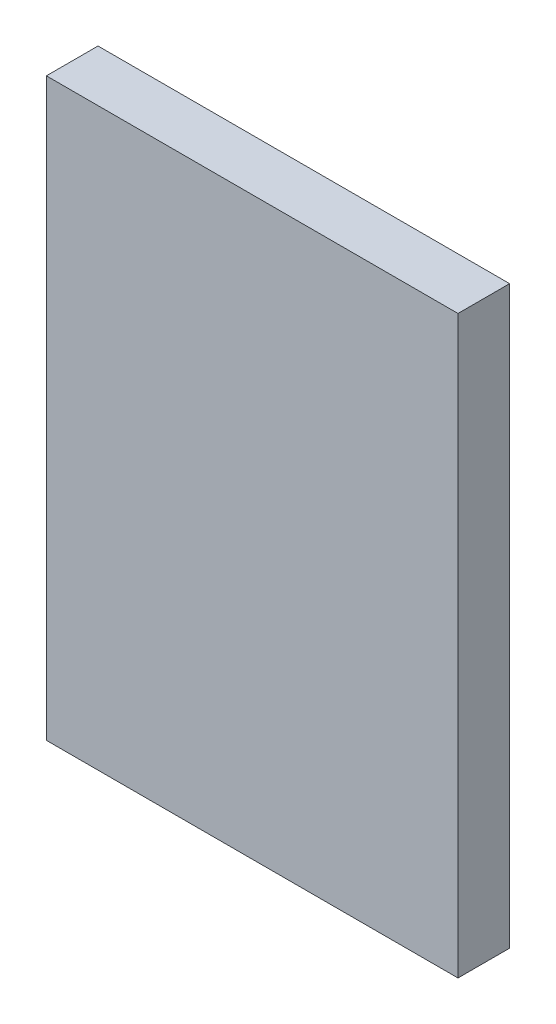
ISO-10303-21;
HEADER;
FILE_DESCRIPTION(('STEP AP214'),'2;1');
FILE_NAME('part.step','',(''),(''),'','','');
FILE_SCHEMA(('AUTOMOTIVE_DESIGN { 1 0 10303 214 1 1 1 1 }'));
ENDSEC;
DATA;
#1=APPLICATION_CONTEXT('core data for automotive mechanical design processes');
#2=APPLICATION_PROTOCOL_DEFINITION('international standard','automotive_design',2000,#1);
#3=PRODUCT_CONTEXT('',#1,'mechanical');
#4=PRODUCT('Part','Part','',(#3));
#5=PRODUCT_RELATED_PRODUCT_CATEGORY('part','',(#4));
#6=PRODUCT_DEFINITION_FORMATION('','',#4);
#7=PRODUCT_DEFINITION_CONTEXT('part definition',#1,'design');
#8=PRODUCT_DEFINITION('design','',#6,#7);
#9=PRODUCT_DEFINITION_SHAPE('','',#8);
#10=(LENGTH_UNIT() NAMED_UNIT(*) SI_UNIT(.MILLI.,.METRE.));
#11=(NAMED_UNIT(*) PLANE_ANGLE_UNIT() SI_UNIT($,.RADIAN.));
#12=(NAMED_UNIT(*) SI_UNIT($,.STERADIAN.) SOLID_ANGLE_UNIT());
#13=UNCERTAINTY_MEASURE_WITH_UNIT(LENGTH_MEASURE(1.E-05),#10,'distance_accuracy_value','');
#14=(GEOMETRIC_REPRESENTATION_CONTEXT(3) GLOBAL_UNCERTAINTY_ASSIGNED_CONTEXT((#13)) GLOBAL_UNIT_ASSIGNED_CONTEXT((#10,
#11,#12)) REPRESENTATION_CONTEXT('',''));
#15=CARTESIAN_POINT('',(0.,0.,0.));
#16=DIRECTION('',(0.,0.,1.));
#17=DIRECTION('',(1.,0.,0.));
#18=AXIS2_PLACEMENT_3D('',#15,#16,#17);
#19=CARTESIAN_POINT('',(0.,0.,8.763));
#20=DIRECTION('',(1.,0.,0.));
#21=DIRECTION('',(0.,0.,-1.));
#22=AXIS2_PLACEMENT_3D('',#19,#20,#21);
#23=PLANE('',#22);
#24=DIRECTION('',(0.,-1.,0.));
#25=VECTOR('',#24,1.);
#26=CARTESIAN_POINT('',(0.,0.,0.));
#27=LINE('',#26,#25);
#28=CARTESIAN_POINT('',(0.,97.663,0.));
#29=VERTEX_POINT('',#28);
#30=CARTESIAN_POINT('',(0.,0.,0.));
#31=VERTEX_POINT('',#30);
#32=EDGE_CURVE('E97',#29,#31,#27,.T.);
#33=ORIENTED_EDGE('',*,*,#32,.T.);
#34=DIRECTION('',(0.,0.,-1.));
#35=VECTOR('',#34,1.);
#36=CARTESIAN_POINT('',(0.,0.,8.763));
#37=LINE('',#36,#35);
#38=CARTESIAN_POINT('',(0.,0.,8.763));
#39=VERTEX_POINT('',#38);
#40=EDGE_CURVE('E11',#39,#31,#37,.T.);
#41=ORIENTED_EDGE('',*,*,#40,.F.);
#42=DIRECTION('',(0.,-1.,0.));
#43=VECTOR('',#42,1.);
#44=CARTESIAN_POINT('',(0.,0.,8.763));
#45=LINE('',#44,#43);
#46=CARTESIAN_POINT('',(0.,97.663,8.763));
#47=VERTEX_POINT('',#46);
#48=EDGE_CURVE('E85',#47,#39,#45,.T.);
#49=ORIENTED_EDGE('',*,*,#48,.F.);
#50=DIRECTION('',(0.,0.,-1.));
#51=VECTOR('',#50,1.);
#52=CARTESIAN_POINT('',(0.,97.663,8.763));
#53=LINE('',#52,#51);
#54=EDGE_CURVE('E93',#47,#29,#53,.T.);
#55=ORIENTED_EDGE('',*,*,#54,.T.);
#56=EDGE_LOOP('',(#33,#41,#49,#55));
#57=FACE_BOUND('',#56,.T.);
#58=ADVANCED_FACE('F34',(#57),#23,.F.);
#59=CARTESIAN_POINT('',(0.,0.,8.763));
#60=DIRECTION('',(0.,1.,0.));
#61=DIRECTION('',(0.,0.,1.));
#62=AXIS2_PLACEMENT_3D('',#59,#60,#61);
#63=PLANE('',#62);
#64=DIRECTION('',(1.,0.,0.));
#65=VECTOR('',#64,1.);
#66=CARTESIAN_POINT('',(0.,0.,0.));
#67=LINE('',#66,#65);
#68=CARTESIAN_POINT('',(69.85,0.,0.));
#69=VERTEX_POINT('',#68);
#70=EDGE_CURVE('E89',#31,#69,#67,.T.);
#71=ORIENTED_EDGE('',*,*,#70,.T.);
#72=DIRECTION('',(0.,0.,-1.));
#73=VECTOR('',#72,1.);
#74=CARTESIAN_POINT('',(69.85,0.,8.763));
#75=LINE('',#74,#73);
#76=CARTESIAN_POINT('',(69.85,0.,8.763));
#77=VERTEX_POINT('',#76);
#78=EDGE_CURVE('E42',#77,#69,#75,.T.);
#79=ORIENTED_EDGE('',*,*,#78,.F.);
#80=DIRECTION('',(1.,0.,0.));
#81=VECTOR('',#80,1.);
#82=CARTESIAN_POINT('',(0.,0.,8.763));
#83=LINE('',#82,#81);
#84=EDGE_CURVE('E80',#39,#77,#83,.T.);
#85=ORIENTED_EDGE('',*,*,#84,.F.);
#86=ORIENTED_EDGE('',*,*,#40,.T.);
#87=EDGE_LOOP('',(#71,#79,#85,#86));
#88=FACE_BOUND('',#87,.T.);
#89=ADVANCED_FACE('F88',(#88),#63,.F.);
#90=CARTESIAN_POINT('',(69.85,0.,8.763));
#91=DIRECTION('',(-1.,0.,0.));
#92=DIRECTION('',(0.,0.,1.));
#93=AXIS2_PLACEMENT_3D('',#90,#91,#92);
#94=PLANE('',#93);
#95=DIRECTION('',(0.,1.,0.));
#96=VECTOR('',#95,1.);
#97=CARTESIAN_POINT('',(69.85,0.,0.));
#98=LINE('',#97,#96);
#99=CARTESIAN_POINT('',(69.85,97.663,0.));
#100=VERTEX_POINT('',#99);
#101=EDGE_CURVE('E67',#69,#100,#98,.T.);
#102=ORIENTED_EDGE('',*,*,#101,.T.);
#103=DIRECTION('',(0.,0.,-1.));
#104=VECTOR('',#103,1.);
#105=CARTESIAN_POINT('',(69.85,97.663,8.763));
#106=LINE('',#105,#104);
#107=CARTESIAN_POINT('',(69.85,97.663,8.763));
#108=VERTEX_POINT('',#107);
#109=EDGE_CURVE('E90',#108,#100,#106,.T.);
#110=ORIENTED_EDGE('',*,*,#109,.F.);
#111=DIRECTION('',(0.,1.,0.));
#112=VECTOR('',#111,1.);
#113=CARTESIAN_POINT('',(69.85,0.,8.763));
#114=LINE('',#113,#112);
#115=EDGE_CURVE('E83',#77,#108,#114,.T.);
#116=ORIENTED_EDGE('',*,*,#115,.F.);
#117=ORIENTED_EDGE('',*,*,#78,.T.);
#118=EDGE_LOOP('',(#102,#110,#116,#117));
#119=FACE_BOUND('',#118,.T.);
#120=ADVANCED_FACE('F91',(#119),#94,.F.);
#121=CARTESIAN_POINT('',(0.,97.663,8.763));
#122=DIRECTION('',(0.,-1.,0.));
#123=DIRECTION('',(0.,0.,-1.));
#124=AXIS2_PLACEMENT_3D('',#121,#122,#123);
#125=PLANE('',#124);
#126=DIRECTION('',(-1.,0.,0.));
#127=VECTOR('',#126,1.);
#128=CARTESIAN_POINT('',(0.,97.663,0.));
#129=LINE('',#128,#127);
#130=EDGE_CURVE('E73',#100,#29,#129,.T.);
#131=ORIENTED_EDGE('',*,*,#130,.T.);
#132=ORIENTED_EDGE('',*,*,#54,.F.);
#133=DIRECTION('',(-1.,0.,0.));
#134=VECTOR('',#133,1.);
#135=CARTESIAN_POINT('',(0.,97.663,8.763));
#136=LINE('',#135,#134);
#137=EDGE_CURVE('E50',#108,#47,#136,.T.);
#138=ORIENTED_EDGE('',*,*,#137,.F.);
#139=ORIENTED_EDGE('',*,*,#109,.T.);
#140=EDGE_LOOP('',(#131,#132,#138,#139));
#141=FACE_BOUND('',#140,.T.);
#142=ADVANCED_FACE('F104',(#141),#125,.F.);
#143=CARTESIAN_POINT('',(0.,97.663,8.763));
#144=DIRECTION('',(0.,0.,-1.));
#145=DIRECTION('',(-1.,0.,0.));
#146=AXIS2_PLACEMENT_3D('',#143,#144,#145);
#147=PLANE('',#146);
#148=ORIENTED_EDGE('',*,*,#48,.T.);
#149=ORIENTED_EDGE('',*,*,#84,.T.);
#150=ORIENTED_EDGE('',*,*,#115,.T.);
#151=ORIENTED_EDGE('',*,*,#137,.T.);
#152=EDGE_LOOP('',(#148,#149,#150,#151));
#153=FACE_BOUND('',#152,.T.);
#154=ADVANCED_FACE('F81',(#153),#147,.F.);
#155=CARTESIAN_POINT('',(0.,97.663,0.));
#156=DIRECTION('',(0.,0.,-1.));
#157=DIRECTION('',(-1.,0.,0.));
#158=AXIS2_PLACEMENT_3D('',#155,#156,#157);
#159=PLANE('',#158);
#160=ORIENTED_EDGE('',*,*,#32,.F.);
#161=ORIENTED_EDGE('',*,*,#130,.F.);
#162=ORIENTED_EDGE('',*,*,#101,.F.);
#163=ORIENTED_EDGE('',*,*,#70,.F.);
#164=EDGE_LOOP('',(#160,#161,#162,#163));
#165=FACE_BOUND('',#164,.T.);
#166=ADVANCED_FACE('F107',(#165),#159,.T.);
#167=CLOSED_SHELL('',(#58,#89,#120,#142,#154,#166));
#168=MANIFOLD_SOLID_BREP('B2',#167);
#169=ADVANCED_BREP_SHAPE_REPRESENTATION('',(#18,#168),#14);
#170=SHAPE_DEFINITION_REPRESENTATION(#9,#169);
ENDSEC;
END-ISO-10303-21;
